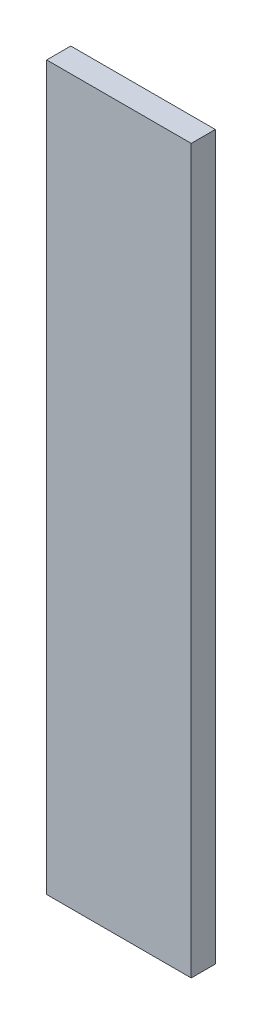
ISO-10303-21;
HEADER;
FILE_DESCRIPTION(('STEP AP214'),'2;1');
FILE_NAME('part.step','',(''),(''),'','','');
FILE_SCHEMA(('AUTOMOTIVE_DESIGN { 1 0 10303 214 1 1 1 1 }'));
ENDSEC;
DATA;
#1=APPLICATION_CONTEXT('core data for automotive mechanical design processes');
#2=APPLICATION_PROTOCOL_DEFINITION('international standard','automotive_design',2000,#1);
#3=PRODUCT_CONTEXT('',#1,'mechanical');
#4=PRODUCT('Part','Part','',(#3));
#5=PRODUCT_RELATED_PRODUCT_CATEGORY('part','',(#4));
#6=PRODUCT_DEFINITION_FORMATION('','',#4);
#7=PRODUCT_DEFINITION_CONTEXT('part definition',#1,'design');
#8=PRODUCT_DEFINITION('design','',#6,#7);
#9=PRODUCT_DEFINITION_SHAPE('','',#8);
#10=(LENGTH_UNIT() NAMED_UNIT(*) SI_UNIT(.MILLI.,.METRE.));
#11=(NAMED_UNIT(*) PLANE_ANGLE_UNIT() SI_UNIT($,.RADIAN.));
#12=(NAMED_UNIT(*) SI_UNIT($,.STERADIAN.) SOLID_ANGLE_UNIT());
#13=UNCERTAINTY_MEASURE_WITH_UNIT(LENGTH_MEASURE(1.E-05),#10,'distance_accuracy_value','');
#14=(GEOMETRIC_REPRESENTATION_CONTEXT(3) GLOBAL_UNCERTAINTY_ASSIGNED_CONTEXT((#13)) GLOBAL_UNIT_ASSIGNED_CONTEXT((#10,
#11,#12)) REPRESENTATION_CONTEXT('',''));
#15=CARTESIAN_POINT('',(0.,0.,0.));
#16=DIRECTION('',(0.,0.,1.));
#17=DIRECTION('',(1.,0.,0.));
#18=AXIS2_PLACEMENT_3D('',#15,#16,#17);
#19=CARTESIAN_POINT('',(0.,0.,10.));
#20=DIRECTION('',(1.,0.,0.));
#21=DIRECTION('',(0.,0.,-1.));
#22=AXIS2_PLACEMENT_3D('',#19,#20,#21);
#23=PLANE('',#22);
#24=DIRECTION('',(0.,-1.,0.));
#25=VECTOR('',#24,1.);
#26=CARTESIAN_POINT('',(0.,0.,0.));
#27=LINE('',#26,#25);
#28=CARTESIAN_POINT('',(0.,300.,0.));
#29=VERTEX_POINT('',#28);
#30=CARTESIAN_POINT('',(0.,0.,0.));
#31=VERTEX_POINT('',#30);
#32=EDGE_CURVE('E96',#29,#31,#27,.T.);
#33=ORIENTED_EDGE('',*,*,#32,.T.);
#34=DIRECTION('',(0.,0.,-1.));
#35=VECTOR('',#34,1.);
#36=CARTESIAN_POINT('',(0.,0.,10.));
#37=LINE('',#36,#35);
#38=CARTESIAN_POINT('',(0.,0.,10.));
#39=VERTEX_POINT('',#38);
#40=EDGE_CURVE('E11',#39,#31,#37,.T.);
#41=ORIENTED_EDGE('',*,*,#40,.F.);
#42=DIRECTION('',(0.,-1.,0.));
#43=VECTOR('',#42,1.);
#44=CARTESIAN_POINT('',(0.,0.,10.));
#45=LINE('',#44,#43);
#46=CARTESIAN_POINT('',(0.,300.,10.));
#47=VERTEX_POINT('',#46);
#48=EDGE_CURVE('E84',#47,#39,#45,.T.);
#49=ORIENTED_EDGE('',*,*,#48,.F.);
#50=DIRECTION('',(0.,0.,-1.));
#51=VECTOR('',#50,1.);
#52=CARTESIAN_POINT('',(0.,300.,10.));
#53=LINE('',#52,#51);
#54=EDGE_CURVE('E92',#47,#29,#53,.T.);
#55=ORIENTED_EDGE('',*,*,#54,.T.);
#56=EDGE_LOOP('',(#33,#41,#49,#55));
#57=FACE_BOUND('',#56,.T.);
#58=ADVANCED_FACE('F33',(#57),#23,.F.);
#59=CARTESIAN_POINT('',(0.,0.,10.));
#60=DIRECTION('',(0.,1.,0.));
#61=DIRECTION('',(0.,0.,1.));
#62=AXIS2_PLACEMENT_3D('',#59,#60,#61);
#63=PLANE('',#62);
#64=DIRECTION('',(1.,0.,0.));
#65=VECTOR('',#64,1.);
#66=CARTESIAN_POINT('',(0.,0.,0.));
#67=LINE('',#66,#65);
#68=CARTESIAN_POINT('',(60.,0.,0.));
#69=VERTEX_POINT('',#68);
#70=EDGE_CURVE('E88',#31,#69,#67,.T.);
#71=ORIENTED_EDGE('',*,*,#70,.T.);
#72=DIRECTION('',(0.,0.,-1.));
#73=VECTOR('',#72,1.);
#74=CARTESIAN_POINT('',(60.,0.,10.));
#75=LINE('',#74,#73);
#76=CARTESIAN_POINT('',(60.,0.,10.));
#77=VERTEX_POINT('',#76);
#78=EDGE_CURVE('E41',#77,#69,#75,.T.);
#79=ORIENTED_EDGE('',*,*,#78,.F.);
#80=DIRECTION('',(1.,0.,0.));
#81=VECTOR('',#80,1.);
#82=CARTESIAN_POINT('',(0.,0.,10.));
#83=LINE('',#82,#81);
#84=EDGE_CURVE('E79',#39,#77,#83,.T.);
#85=ORIENTED_EDGE('',*,*,#84,.F.);
#86=ORIENTED_EDGE('',*,*,#40,.T.);
#87=EDGE_LOOP('',(#71,#79,#85,#86));
#88=FACE_BOUND('',#87,.T.);
#89=ADVANCED_FACE('F87',(#88),#63,.F.);
#90=CARTESIAN_POINT('',(60.,0.,10.));
#91=DIRECTION('',(-1.,0.,0.));
#92=DIRECTION('',(0.,0.,1.));
#93=AXIS2_PLACEMENT_3D('',#90,#91,#92);
#94=PLANE('',#93);
#95=DIRECTION('',(0.,1.,0.));
#96=VECTOR('',#95,1.);
#97=CARTESIAN_POINT('',(60.,0.,0.));
#98=LINE('',#97,#96);
#99=CARTESIAN_POINT('',(60.,300.,0.));
#100=VERTEX_POINT('',#99);
#101=EDGE_CURVE('E66',#69,#100,#98,.T.);
#102=ORIENTED_EDGE('',*,*,#101,.T.);
#103=DIRECTION('',(0.,0.,-1.));
#104=VECTOR('',#103,1.);
#105=CARTESIAN_POINT('',(60.,300.,10.));
#106=LINE('',#105,#104);
#107=CARTESIAN_POINT('',(60.,300.,10.));
#108=VERTEX_POINT('',#107);
#109=EDGE_CURVE('E89',#108,#100,#106,.T.);
#110=ORIENTED_EDGE('',*,*,#109,.F.);
#111=DIRECTION('',(0.,1.,0.));
#112=VECTOR('',#111,1.);
#113=CARTESIAN_POINT('',(60.,0.,10.));
#114=LINE('',#113,#112);
#115=EDGE_CURVE('E82',#77,#108,#114,.T.);
#116=ORIENTED_EDGE('',*,*,#115,.F.);
#117=ORIENTED_EDGE('',*,*,#78,.T.);
#118=EDGE_LOOP('',(#102,#110,#116,#117));
#119=FACE_BOUND('',#118,.T.);
#120=ADVANCED_FACE('F90',(#119),#94,.F.);
#121=CARTESIAN_POINT('',(0.,300.,10.));
#122=DIRECTION('',(0.,-1.,0.));
#123=DIRECTION('',(0.,0.,-1.));
#124=AXIS2_PLACEMENT_3D('',#121,#122,#123);
#125=PLANE('',#124);
#126=DIRECTION('',(-1.,0.,0.));
#127=VECTOR('',#126,1.);
#128=CARTESIAN_POINT('',(0.,300.,0.));
#129=LINE('',#128,#127);
#130=EDGE_CURVE('E72',#100,#29,#129,.T.);
#131=ORIENTED_EDGE('',*,*,#130,.T.);
#132=ORIENTED_EDGE('',*,*,#54,.F.);
#133=DIRECTION('',(-1.,0.,0.));
#134=VECTOR('',#133,1.);
#135=CARTESIAN_POINT('',(0.,300.,10.));
#136=LINE('',#135,#134);
#137=EDGE_CURVE('E49',#108,#47,#136,.T.);
#138=ORIENTED_EDGE('',*,*,#137,.F.);
#139=ORIENTED_EDGE('',*,*,#109,.T.);
#140=EDGE_LOOP('',(#131,#132,#138,#139));
#141=FACE_BOUND('',#140,.T.);
#142=ADVANCED_FACE('F103',(#141),#125,.F.);
#143=CARTESIAN_POINT('',(0.,0.,10.));
#144=DIRECTION('',(0.,0.,-1.));
#145=DIRECTION('',(-1.,0.,0.));
#146=AXIS2_PLACEMENT_3D('',#143,#144,#145);
#147=PLANE('',#146);
#148=ORIENTED_EDGE('',*,*,#48,.T.);
#149=ORIENTED_EDGE('',*,*,#84,.T.);
#150=ORIENTED_EDGE('',*,*,#115,.T.);
#151=ORIENTED_EDGE('',*,*,#137,.T.);
#152=EDGE_LOOP('',(#148,#149,#150,#151));
#153=FACE_BOUND('',#152,.T.);
#154=ADVANCED_FACE('F80',(#153),#147,.F.);
#155=CARTESIAN_POINT('',(0.,0.,0.));
#156=DIRECTION('',(0.,0.,-1.));
#157=DIRECTION('',(-1.,0.,0.));
#158=AXIS2_PLACEMENT_3D('',#155,#156,#157);
#159=PLANE('',#158);
#160=ORIENTED_EDGE('',*,*,#32,.F.);
#161=ORIENTED_EDGE('',*,*,#130,.F.);
#162=ORIENTED_EDGE('',*,*,#101,.F.);
#163=ORIENTED_EDGE('',*,*,#70,.F.);
#164=EDGE_LOOP('',(#160,#161,#162,#163));
#165=FACE_BOUND('',#164,.T.);
#166=ADVANCED_FACE('F106',(#165),#159,.T.);
#167=CLOSED_SHELL('',(#58,#89,#120,#142,#154,#166));
#168=MANIFOLD_SOLID_BREP('B2',#167);
#169=ADVANCED_BREP_SHAPE_REPRESENTATION('',(#18,#168),#14);
#170=SHAPE_DEFINITION_REPRESENTATION(#9,#169);
ENDSEC;
END-ISO-10303-21;
